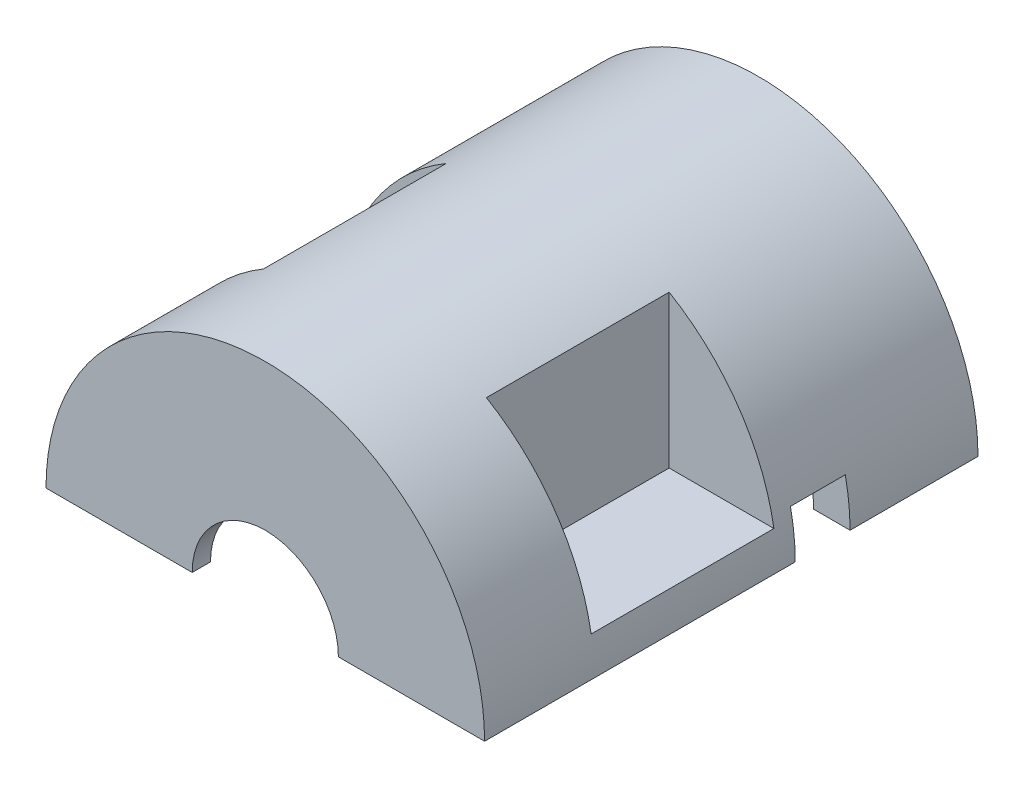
from build123d import *

# Parameters (mm, degrees)
SKETCH1_R               = 15.24
BOSS_EXTRUDE1_DEPTH     = 34.29
SKETCH2_W               = 32.682424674
SKETCH2_H               = 21.450914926
CUT_EXTRUDE1_DEPTH      = 41.500855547
CUT_EXTRUDE2_START      = -2.54
SKETCH5_W               = 10.885429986
SKETCH5_H               = 12.7
CUT_EXTRUDE2_DEPTH      = 38.960855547
CUT_EXTRUDE5_DEPTH      = 41.500855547
CUT_EXTRUDE5_DEPTH_BACK = 41.500855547
SKETCH8_W               = 3.81
SKETCH8_H               = 3.175


with BuildPart() as part:
    # Sketch1 → Boss-Extrude1 (new body)
    with BuildSketch(Plane.XY):
        Circle(SKETCH1_R)
    extrude(amount=BOSS_EXTRUDE1_DEPTH)

    # Sketch2 → Cut-Extrude1 (cut, through all)
    with BuildSketch(Plane.XY.offset(34.29)):
        with Locations((1.101212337, -10.725457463)):
            Rectangle(SKETCH2_W, SKETCH2_H)
    extrude(amount=-CUT_EXTRUDE1_DEPTH, mode=Mode.SUBTRACT)

    # Sketch3 → Cut-Revolve1 (revolve, cut)
    with BuildSketch(Plane.XZ):
        Polygon((5.08, 34.29), (5.08, 33.02), (7.9375, 33.02), (7.9375, 27.94), (5.207, 27.94), (5.207, 12.7), (12.7, 12.7), (12.7, 0), (0, 0), (0, 34.29), align=None)
    revolve(axis=Axis((0, 0, -2.016739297), (0, 0, 1)), mode=Mode.SUBTRACT)

    # Sketch5 → Cut-Extrude2 (cut, through all)
    with BuildSketch(Plane(origin=(0, 0, 0), x_dir=(-1, 0, 0), z_dir=(0, -1, 0)).offset(CUT_EXTRUDE2_START)):
        with Locations((13.189714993, -20.32)):
            Rectangle(SKETCH5_W, SKETCH5_H)
        with Locations((-13.189714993, -20.32)):
            Rectangle(SKETCH5_W, SKETCH5_H)
    extrude(amount=-CUT_EXTRUDE2_DEPTH, mode=Mode.SUBTRACT)

    # Sketch8 → Cut-Extrude5 (cut, two sides: drawn at the far end of the back side and taken through both)
    with BuildSketch(Plane(origin=(0, 0, 0), x_dir=(0, 0, -1), z_dir=(1, 0, 0)).offset(-CUT_EXTRUDE5_DEPTH_BACK)):
        with Locations((-10.795, 1.5875)):
            Rectangle(SKETCH8_W, SKETCH8_H)
    extrude(amount=CUT_EXTRUDE5_DEPTH + CUT_EXTRUDE5_DEPTH_BACK, mode=Mode.SUBTRACT)


solid = part.part
